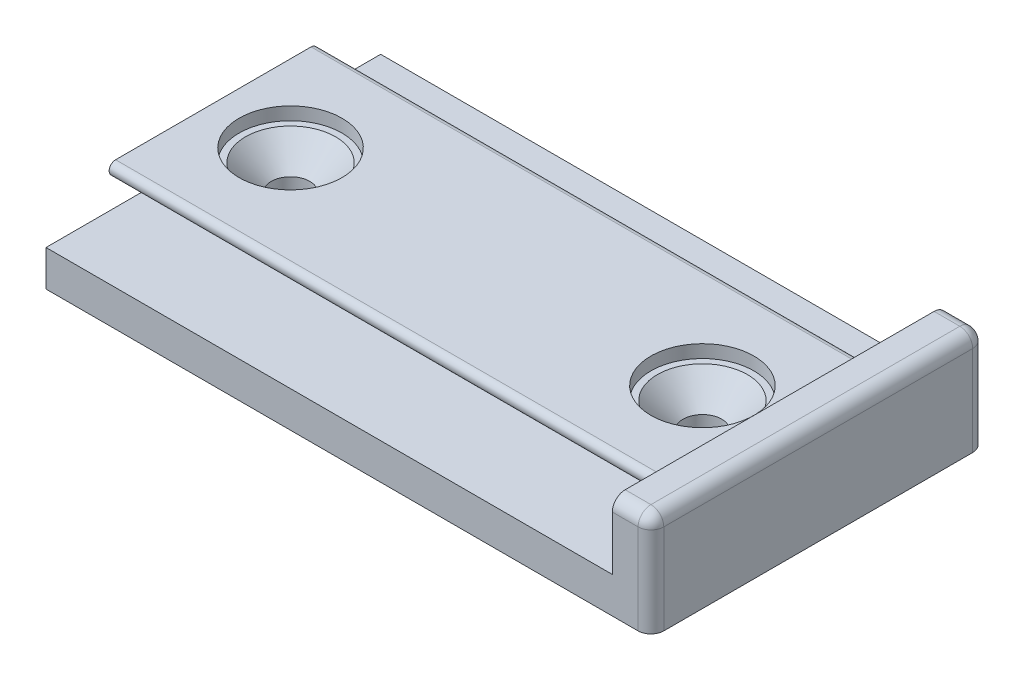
ISO-10303-21;
HEADER;
FILE_DESCRIPTION(('STEP AP214'),'2;1');
FILE_NAME('part.step','',(''),(''),'','','');
FILE_SCHEMA(('AUTOMOTIVE_DESIGN { 1 0 10303 214 1 1 1 1 }'));
ENDSEC;
DATA;
#1=APPLICATION_CONTEXT('core data for automotive mechanical design processes');
#2=APPLICATION_PROTOCOL_DEFINITION('international standard','automotive_design',2000,#1);
#3=PRODUCT_CONTEXT('',#1,'mechanical');
#4=PRODUCT('Part','Part','',(#3));
#5=PRODUCT_RELATED_PRODUCT_CATEGORY('part','',(#4));
#6=PRODUCT_DEFINITION_FORMATION('','',#4);
#7=PRODUCT_DEFINITION_CONTEXT('part definition',#1,'design');
#8=PRODUCT_DEFINITION('design','',#6,#7);
#9=PRODUCT_DEFINITION_SHAPE('','',#8);
#10=(LENGTH_UNIT() NAMED_UNIT(*) SI_UNIT(.MILLI.,.METRE.));
#11=(NAMED_UNIT(*) PLANE_ANGLE_UNIT() SI_UNIT($,.RADIAN.));
#12=(NAMED_UNIT(*) SI_UNIT($,.STERADIAN.) SOLID_ANGLE_UNIT());
#13=UNCERTAINTY_MEASURE_WITH_UNIT(LENGTH_MEASURE(1.E-05),#10,'distance_accuracy_value','');
#14=(GEOMETRIC_REPRESENTATION_CONTEXT(3) GLOBAL_UNCERTAINTY_ASSIGNED_CONTEXT((#13)) GLOBAL_UNIT_ASSIGNED_CONTEXT((#10,
#11,#12)) REPRESENTATION_CONTEXT('',''));
#15=CARTESIAN_POINT('',(0.,0.,0.));
#16=DIRECTION('',(0.,0.,1.));
#17=DIRECTION('',(1.,0.,0.));
#18=AXIS2_PLACEMENT_3D('',#15,#16,#17);
#19=CARTESIAN_POINT('',(38.,-4.,13.));
#20=DIRECTION('',(0.,1.,0.));
#21=DIRECTION('',(0.,0.,1.));
#22=AXIS2_PLACEMENT_3D('',#19,#20,#21);
#23=CYLINDRICAL_SURFACE('',#22,1.5);
#24=CARTESIAN_POINT('',(38.,3.,13.));
#25=DIRECTION('',(0.,1.,0.));
#26=DIRECTION('',(0.,0.,1.));
#27=AXIS2_PLACEMENT_3D('',#24,#25,#26);
#28=CIRCLE('',#27,1.5);
#29=CARTESIAN_POINT('',(38.,3.,14.5));
#30=VERTEX_POINT('',#29);
#31=EDGE_CURVE('E282',#30,#30,#28,.T.);
#32=ORIENTED_EDGE('',*,*,#31,.T.);
#33=EDGE_LOOP('',(#32));
#34=FACE_BOUND('',#33,.T.);
#35=CARTESIAN_POINT('',(38.,0.,13.));
#36=DIRECTION('',(0.,1.,0.));
#37=DIRECTION('',(0.,0.,1.));
#38=AXIS2_PLACEMENT_3D('',#35,#36,#37);
#39=CIRCLE('',#38,1.5);
#40=CARTESIAN_POINT('',(38.,0.,14.5));
#41=VERTEX_POINT('',#40);
#42=EDGE_CURVE('E212',#41,#41,#39,.F.);
#43=ORIENTED_EDGE('',*,*,#42,.T.);
#44=EDGE_LOOP('',(#43));
#45=FACE_BOUND('',#44,.T.);
#46=ADVANCED_FACE('F32',(#34,#45),#23,.F.);
#47=CARTESIAN_POINT('',(0.,6.,0.));
#48=DIRECTION('',(0.,1.,0.));
#49=DIRECTION('',(0.,0.,1.));
#50=AXIS2_PLACEMENT_3D('',#47,#48,#49);
#51=PLANE('',#50);
#52=CARTESIAN_POINT('',(38.,6.,13.));
#53=DIRECTION('',(0.,1.,0.));
#54=DIRECTION('',(0.,0.,1.));
#55=AXIS2_PLACEMENT_3D('',#52,#53,#54);
#56=CIRCLE('',#55,4.00000000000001);
#57=CARTESIAN_POINT('',(38.,6.,17.));
#58=VERTEX_POINT('',#57);
#59=EDGE_CURVE('E202',#58,#58,#56,.T.);
#60=ORIENTED_EDGE('',*,*,#59,.F.);
#61=EDGE_LOOP('',(#60));
#62=FACE_BOUND('',#61,.T.);
#63=DIRECTION('',(0.,0.,-1.));
#64=VECTOR('',#63,1.);
#65=CARTESIAN_POINT('',(44.,6.,0.));
#66=LINE('',#65,#64);
#67=CARTESIAN_POINT('',(44.,6.,20.5928932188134));
#68=VERTEX_POINT('',#67);
#69=CARTESIAN_POINT('',(44.,6.,5.40710678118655));
#70=VERTEX_POINT('',#69);
#71=EDGE_CURVE('E363',#68,#70,#66,.T.);
#72=ORIENTED_EDGE('',*,*,#71,.T.);
#73=DIRECTION('',(1.,0.,0.));
#74=VECTOR('',#73,1.);
#75=CARTESIAN_POINT('',(0.,6.,5.40710678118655));
#76=LINE('',#75,#74);
#77=CARTESIAN_POINT('',(0.,6.,5.40710678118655));
#78=VERTEX_POINT('',#77);
#79=EDGE_CURVE('E257',#70,#78,#76,.F.);
#80=ORIENTED_EDGE('',*,*,#79,.T.);
#81=DIRECTION('',(0.,0.,1.));
#82=VECTOR('',#81,1.);
#83=CARTESIAN_POINT('',(0.,6.,0.));
#84=LINE('',#83,#82);
#85=CARTESIAN_POINT('',(0.,6.,20.5928932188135));
#86=VERTEX_POINT('',#85);
#87=EDGE_CURVE('E359',#78,#86,#84,.T.);
#88=ORIENTED_EDGE('',*,*,#87,.T.);
#89=DIRECTION('',(1.,0.,0.));
#90=VECTOR('',#89,1.);
#91=CARTESIAN_POINT('',(44.,6.,20.5928932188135));
#92=LINE('',#91,#90);
#93=EDGE_CURVE('E258',#86,#68,#92,.T.);
#94=ORIENTED_EDGE('',*,*,#93,.T.);
#95=EDGE_LOOP('',(#72,#80,#88,#94));
#96=FACE_BOUND('',#95,.T.);
#97=CARTESIAN_POINT('',(6.,6.,13.));
#98=DIRECTION('',(0.,-1.,0.));
#99=DIRECTION('',(0.,0.,-1.));
#100=AXIS2_PLACEMENT_3D('',#97,#98,#99);
#101=CIRCLE('',#100,4.);
#102=CARTESIAN_POINT('',(6.,6.,9.));
#103=VERTEX_POINT('',#102);
#104=EDGE_CURVE('E205',#103,#103,#101,.T.);
#105=ORIENTED_EDGE('',*,*,#104,.T.);
#106=EDGE_LOOP('',(#105));
#107=FACE_BOUND('',#106,.T.);
#108=ADVANCED_FACE('F307',(#62,#96,#107),#51,.T.);
#109=CARTESIAN_POINT('',(0.,0.,0.));
#110=DIRECTION('',(0.,1.,0.));
#111=DIRECTION('',(0.,0.,1.));
#112=AXIS2_PLACEMENT_3D('',#109,#110,#111);
#113=PLANE('',#112);
#114=DIRECTION('',(-1.,0.,0.));
#115=VECTOR('',#114,1.);
#116=CARTESIAN_POINT('',(0.,0.,0.));
#117=LINE('',#116,#115);
#118=CARTESIAN_POINT('',(46.,0.,0.));
#119=VERTEX_POINT('',#118);
#120=CARTESIAN_POINT('',(0.,0.,0.));
#121=VERTEX_POINT('',#120);
#122=EDGE_CURVE('E364',#119,#121,#117,.T.);
#123=ORIENTED_EDGE('',*,*,#122,.F.);
#124=CARTESIAN_POINT('',(46.,0.,1.));
#125=DIRECTION('',(0.,1.,0.));
#126=DIRECTION('',(0.,0.,1.));
#127=AXIS2_PLACEMENT_3D('',#124,#125,#126);
#128=CIRCLE('',#127,1.);
#129=CARTESIAN_POINT('',(47.,0.,1.00000000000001));
#130=VERTEX_POINT('',#129);
#131=EDGE_CURVE('E384',#119,#130,#128,.F.);
#132=ORIENTED_EDGE('',*,*,#131,.T.);
#133=DIRECTION('',(0.,0.,-1.));
#134=VECTOR('',#133,1.);
#135=CARTESIAN_POINT('',(47.,0.,26.));
#136=LINE('',#135,#134);
#137=CARTESIAN_POINT('',(47.,0.,25.));
#138=VERTEX_POINT('',#137);
#139=EDGE_CURVE('E195',#138,#130,#136,.T.);
#140=ORIENTED_EDGE('',*,*,#139,.F.);
#141=CARTESIAN_POINT('',(46.,0.,25.));
#142=DIRECTION('',(0.,1.,0.));
#143=DIRECTION('',(0.,0.,1.));
#144=AXIS2_PLACEMENT_3D('',#141,#142,#143);
#145=CIRCLE('',#144,1.);
#146=CARTESIAN_POINT('',(46.,0.,26.));
#147=VERTEX_POINT('',#146);
#148=EDGE_CURVE('E55',#138,#147,#145,.F.);
#149=ORIENTED_EDGE('',*,*,#148,.T.);
#150=DIRECTION('',(1.,0.,0.));
#151=VECTOR('',#150,1.);
#152=CARTESIAN_POINT('',(0.,0.,26.));
#153=LINE('',#152,#151);
#154=CARTESIAN_POINT('',(0.,0.,26.));
#155=VERTEX_POINT('',#154);
#156=EDGE_CURVE('E368',#155,#147,#153,.T.);
#157=ORIENTED_EDGE('',*,*,#156,.F.);
#158=DIRECTION('',(0.,0.,1.));
#159=VECTOR('',#158,1.);
#160=CARTESIAN_POINT('',(0.,0.,0.));
#161=LINE('',#160,#159);
#162=EDGE_CURVE('E172',#121,#155,#161,.T.);
#163=ORIENTED_EDGE('',*,*,#162,.F.);
#164=EDGE_LOOP('',(#123,#132,#140,#149,#157,#163));
#165=FACE_BOUND('',#164,.T.);
#166=CARTESIAN_POINT('',(6.,0.,13.));
#167=DIRECTION('',(0.,1.,0.));
#168=DIRECTION('',(0.,0.,1.));
#169=AXIS2_PLACEMENT_3D('',#166,#167,#168);
#170=CIRCLE('',#169,1.5);
#171=CARTESIAN_POINT('',(6.,0.,14.5));
#172=VERTEX_POINT('',#171);
#173=EDGE_CURVE('E225',#172,#172,#170,.T.);
#174=ORIENTED_EDGE('',*,*,#173,.T.);
#175=EDGE_LOOP('',(#174));
#176=FACE_BOUND('',#175,.T.);
#177=ORIENTED_EDGE('',*,*,#42,.F.);
#178=EDGE_LOOP('',(#177));
#179=FACE_BOUND('',#178,.T.);
#180=ADVANCED_FACE('F312',(#165,#176,#179),#113,.F.);
#181=CARTESIAN_POINT('',(0.,6.,0.));
#182=DIRECTION('',(1.,0.,0.));
#183=DIRECTION('',(0.,0.,-1.));
#184=AXIS2_PLACEMENT_3D('',#181,#182,#183);
#185=PLANE('',#184);
#186=ORIENTED_EDGE('',*,*,#87,.F.);
#187=CARTESIAN_POINT('',(0.,5.5,5.40710678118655));
#188=DIRECTION('',(1.,0.,0.));
#189=DIRECTION('',(0.,0.,-1.));
#190=AXIS2_PLACEMENT_3D('',#187,#188,#189);
#191=CIRCLE('',#190,0.5);
#192=CARTESIAN_POINT('',(0.,5.14644660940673,5.05355339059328));
#193=VERTEX_POINT('',#192);
#194=EDGE_CURVE('E269',#78,#193,#191,.F.);
#195=ORIENTED_EDGE('',*,*,#194,.T.);
#196=DIRECTION('',(0.,-0.707106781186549,0.707106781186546));
#197=VECTOR('',#196,1.);
#198=CARTESIAN_POINT('',(0.,6.,4.20000000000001));
#199=LINE('',#198,#197);
#200=CARTESIAN_POINT('',(0.,2.8,7.4));
#201=VERTEX_POINT('',#200);
#202=EDGE_CURVE('E215',#193,#201,#199,.T.);
#203=ORIENTED_EDGE('',*,*,#202,.T.);
#204=DIRECTION('',(0.,0.,-1.));
#205=VECTOR('',#204,1.);
#206=CARTESIAN_POINT('',(0.,2.8,7.4));
#207=LINE('',#206,#205);
#208=CARTESIAN_POINT('',(0.,2.8,0.));
#209=VERTEX_POINT('',#208);
#210=EDGE_CURVE('E217',#201,#209,#207,.T.);
#211=ORIENTED_EDGE('',*,*,#210,.T.);
#212=DIRECTION('',(0.,-1.,0.));
#213=VECTOR('',#212,1.);
#214=CARTESIAN_POINT('',(0.,6.,0.));
#215=LINE('',#214,#213);
#216=EDGE_CURVE('E366',#209,#121,#215,.T.);
#217=ORIENTED_EDGE('',*,*,#216,.T.);
#218=ORIENTED_EDGE('',*,*,#162,.T.);
#219=DIRECTION('',(0.,-1.,0.));
#220=VECTOR('',#219,1.);
#221=CARTESIAN_POINT('',(0.,6.,26.));
#222=LINE('',#221,#220);
#223=CARTESIAN_POINT('',(0.,2.8,26.));
#224=VERTEX_POINT('',#223);
#225=EDGE_CURVE('E377',#224,#155,#222,.T.);
#226=ORIENTED_EDGE('',*,*,#225,.F.);
#227=DIRECTION('',(0.,0.,-1.));
#228=VECTOR('',#227,1.);
#229=CARTESIAN_POINT('',(0.,2.8,18.6));
#230=LINE('',#229,#228);
#231=CARTESIAN_POINT('',(0.,2.8,18.6));
#232=VERTEX_POINT('',#231);
#233=EDGE_CURVE('E168',#224,#232,#230,.T.);
#234=ORIENTED_EDGE('',*,*,#233,.T.);
#235=DIRECTION('',(0.,0.707106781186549,0.707106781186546));
#236=VECTOR('',#235,1.);
#237=CARTESIAN_POINT('',(0.,6.,21.8));
#238=LINE('',#237,#236);
#239=CARTESIAN_POINT('',(0.,5.14644660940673,20.9464466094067));
#240=VERTEX_POINT('',#239);
#241=EDGE_CURVE('E170',#232,#240,#238,.T.);
#242=ORIENTED_EDGE('',*,*,#241,.T.);
#243=CARTESIAN_POINT('',(0.,5.5,20.5928932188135));
#244=DIRECTION('',(1.,0.,0.));
#245=DIRECTION('',(0.,0.,-1.));
#246=AXIS2_PLACEMENT_3D('',#243,#244,#245);
#247=CIRCLE('',#246,0.5);
#248=EDGE_CURVE('E267',#240,#86,#247,.F.);
#249=ORIENTED_EDGE('',*,*,#248,.T.);
#250=EDGE_LOOP('',(#186,#195,#203,#211,#217,#218,#226,#234,#242,#249));
#251=FACE_BOUND('',#250,.T.);
#252=ADVANCED_FACE('F339',(#251),#185,.F.);
#253=CARTESIAN_POINT('',(0.,6.,26.));
#254=DIRECTION('',(0.,0.,-1.));
#255=DIRECTION('',(-1.,0.,0.));
#256=AXIS2_PLACEMENT_3D('',#253,#254,#255);
#257=PLANE('',#256);
#258=ORIENTED_EDGE('',*,*,#156,.T.);
#259=DIRECTION('',(0.,-1.,0.));
#260=VECTOR('',#259,1.);
#261=CARTESIAN_POINT('',(46.,6.,26.));
#262=LINE('',#261,#260);
#263=CARTESIAN_POINT('',(46.,7.,26.));
#264=VERTEX_POINT('',#263);
#265=EDGE_CURVE('E11',#147,#264,#262,.F.);
#266=ORIENTED_EDGE('',*,*,#265,.T.);
#267=DIRECTION('',(-1.,0.,0.));
#268=VECTOR('',#267,1.);
#269=CARTESIAN_POINT('',(0.,7.,26.));
#270=LINE('',#269,#268);
#271=CARTESIAN_POINT('',(44.,7.,26.));
#272=VERTEX_POINT('',#271);
#273=EDGE_CURVE('E41',#264,#272,#270,.T.);
#274=ORIENTED_EDGE('',*,*,#273,.T.);
#275=DIRECTION('',(0.,-1.,0.));
#276=VECTOR('',#275,1.);
#277=CARTESIAN_POINT('',(44.,0.,26.));
#278=LINE('',#277,#276);
#279=CARTESIAN_POINT('',(44.,2.8,26.));
#280=VERTEX_POINT('',#279);
#281=EDGE_CURVE('E146',#272,#280,#278,.T.);
#282=ORIENTED_EDGE('',*,*,#281,.T.);
#283=DIRECTION('',(1.,0.,0.));
#284=VECTOR('',#283,1.);
#285=CARTESIAN_POINT('',(0.,2.8,26.));
#286=LINE('',#285,#284);
#287=EDGE_CURVE('E150',#224,#280,#286,.T.);
#288=ORIENTED_EDGE('',*,*,#287,.F.);
#289=ORIENTED_EDGE('',*,*,#225,.T.);
#290=EDGE_LOOP('',(#258,#266,#274,#282,#288,#289));
#291=FACE_BOUND('',#290,.T.);
#292=ADVANCED_FACE('F148',(#291),#257,.F.);
#293=CARTESIAN_POINT('',(0.,6.,0.));
#294=DIRECTION('',(0.,0.,1.));
#295=DIRECTION('',(1.,0.,0.));
#296=AXIS2_PLACEMENT_3D('',#293,#294,#295);
#297=PLANE('',#296);
#298=DIRECTION('',(0.,1.,0.));
#299=VECTOR('',#298,1.);
#300=CARTESIAN_POINT('',(44.,0.,0.));
#301=LINE('',#300,#299);
#302=CARTESIAN_POINT('',(44.,2.8,0.));
#303=VERTEX_POINT('',#302);
#304=CARTESIAN_POINT('',(44.,7.,0.));
#305=VERTEX_POINT('',#304);
#306=EDGE_CURVE('E154',#303,#305,#301,.T.);
#307=ORIENTED_EDGE('',*,*,#306,.T.);
#308=DIRECTION('',(-1.,0.,0.));
#309=VECTOR('',#308,1.);
#310=CARTESIAN_POINT('',(0.,7.,0.));
#311=LINE('',#310,#309);
#312=CARTESIAN_POINT('',(46.,7.,0.));
#313=VERTEX_POINT('',#312);
#314=EDGE_CURVE('E431',#305,#313,#311,.F.);
#315=ORIENTED_EDGE('',*,*,#314,.T.);
#316=DIRECTION('',(0.,1.,0.));
#317=VECTOR('',#316,1.);
#318=CARTESIAN_POINT('',(46.,6.,0.));
#319=LINE('',#318,#317);
#320=EDGE_CURVE('E382',#313,#119,#319,.F.);
#321=ORIENTED_EDGE('',*,*,#320,.T.);
#322=ORIENTED_EDGE('',*,*,#122,.T.);
#323=ORIENTED_EDGE('',*,*,#216,.F.);
#324=DIRECTION('',(1.,0.,0.));
#325=VECTOR('',#324,1.);
#326=CARTESIAN_POINT('',(0.,2.8,0.));
#327=LINE('',#326,#325);
#328=EDGE_CURVE('E164',#209,#303,#327,.T.);
#329=ORIENTED_EDGE('',*,*,#328,.T.);
#330=EDGE_LOOP('',(#307,#315,#321,#322,#323,#329));
#331=FACE_BOUND('',#330,.T.);
#332=ADVANCED_FACE('F333',(#331),#297,.F.);
#333=CARTESIAN_POINT('',(0.,6.,21.8));
#334=DIRECTION('',(0.,0.707106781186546,-0.707106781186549));
#335=DIRECTION('',(0.,0.707106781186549,0.707106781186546));
#336=AXIS2_PLACEMENT_3D('',#333,#334,#335);
#337=PLANE('',#336);
#338=DIRECTION('',(0.,0.707106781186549,0.707106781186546));
#339=VECTOR('',#338,1.);
#340=CARTESIAN_POINT('',(44.,6.,21.8));
#341=LINE('',#340,#339);
#342=CARTESIAN_POINT('',(44.,2.8,18.6));
#343=VERTEX_POINT('',#342);
#344=CARTESIAN_POINT('',(44.,5.14644660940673,20.9464466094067));
#345=VERTEX_POINT('',#344);
#346=EDGE_CURVE('E161',#343,#345,#341,.T.);
#347=ORIENTED_EDGE('',*,*,#346,.T.);
#348=DIRECTION('',(1.,0.,0.));
#349=VECTOR('',#348,1.);
#350=CARTESIAN_POINT('',(0.,5.14644660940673,20.9464466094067));
#351=LINE('',#350,#349);
#352=EDGE_CURVE('E271',#345,#240,#351,.F.);
#353=ORIENTED_EDGE('',*,*,#352,.T.);
#354=ORIENTED_EDGE('',*,*,#241,.F.);
#355=DIRECTION('',(1.,0.,0.));
#356=VECTOR('',#355,1.);
#357=CARTESIAN_POINT('',(0.,2.8,18.6));
#358=LINE('',#357,#356);
#359=EDGE_CURVE('E169',#232,#343,#358,.T.);
#360=ORIENTED_EDGE('',*,*,#359,.T.);
#361=EDGE_LOOP('',(#347,#353,#354,#360));
#362=FACE_BOUND('',#361,.T.);
#363=ADVANCED_FACE('F330',(#362),#337,.F.);
#364=CARTESIAN_POINT('',(0.,2.8,18.6));
#365=DIRECTION('',(0.,-1.,0.));
#366=DIRECTION('',(0.,0.,-1.));
#367=AXIS2_PLACEMENT_3D('',#364,#365,#366);
#368=PLANE('',#367);
#369=DIRECTION('',(0.,0.,-1.));
#370=VECTOR('',#369,1.);
#371=CARTESIAN_POINT('',(44.,2.8,18.6));
#372=LINE('',#371,#370);
#373=EDGE_CURVE('E157',#280,#343,#372,.T.);
#374=ORIENTED_EDGE('',*,*,#373,.T.);
#375=ORIENTED_EDGE('',*,*,#359,.F.);
#376=ORIENTED_EDGE('',*,*,#233,.F.);
#377=ORIENTED_EDGE('',*,*,#287,.T.);
#378=EDGE_LOOP('',(#374,#375,#376,#377));
#379=FACE_BOUND('',#378,.T.);
#380=ADVANCED_FACE('F166',(#379),#368,.F.);
#381=CARTESIAN_POINT('',(0.,2.8,7.4));
#382=DIRECTION('',(0.,-1.,0.));
#383=DIRECTION('',(0.,0.,-1.));
#384=AXIS2_PLACEMENT_3D('',#381,#382,#383);
#385=PLANE('',#384);
#386=DIRECTION('',(0.,0.,-1.));
#387=VECTOR('',#386,1.);
#388=CARTESIAN_POINT('',(44.,2.8,7.39999999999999));
#389=LINE('',#388,#387);
#390=CARTESIAN_POINT('',(44.,2.8,7.39999999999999));
#391=VERTEX_POINT('',#390);
#392=EDGE_CURVE('E218',#391,#303,#389,.T.);
#393=ORIENTED_EDGE('',*,*,#392,.T.);
#394=ORIENTED_EDGE('',*,*,#328,.F.);
#395=ORIENTED_EDGE('',*,*,#210,.F.);
#396=DIRECTION('',(1.,0.,0.));
#397=VECTOR('',#396,1.);
#398=CARTESIAN_POINT('',(0.,2.8,7.4));
#399=LINE('',#398,#397);
#400=EDGE_CURVE('E221',#201,#391,#399,.T.);
#401=ORIENTED_EDGE('',*,*,#400,.T.);
#402=EDGE_LOOP('',(#393,#394,#395,#401));
#403=FACE_BOUND('',#402,.T.);
#404=ADVANCED_FACE('F243',(#403),#385,.F.);
#405=CARTESIAN_POINT('',(0.,6.,4.20000000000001));
#406=DIRECTION('',(0.,0.707106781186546,0.707106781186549));
#407=DIRECTION('',(0.,-0.707106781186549,0.707106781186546));
#408=AXIS2_PLACEMENT_3D('',#405,#406,#407);
#409=PLANE('',#408);
#410=ORIENTED_EDGE('',*,*,#202,.F.);
#411=DIRECTION('',(1.,0.,0.));
#412=VECTOR('',#411,1.);
#413=CARTESIAN_POINT('',(44.,5.14644660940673,5.05355339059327));
#414=LINE('',#413,#412);
#415=CARTESIAN_POINT('',(44.,5.14644660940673,5.05355339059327));
#416=VERTEX_POINT('',#415);
#417=EDGE_CURVE('E249',#193,#416,#414,.T.);
#418=ORIENTED_EDGE('',*,*,#417,.T.);
#419=DIRECTION('',(0.,-0.707106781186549,0.707106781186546));
#420=VECTOR('',#419,1.);
#421=CARTESIAN_POINT('',(44.,6.,4.2));
#422=LINE('',#421,#420);
#423=EDGE_CURVE('E222',#416,#391,#422,.T.);
#424=ORIENTED_EDGE('',*,*,#423,.T.);
#425=ORIENTED_EDGE('',*,*,#400,.F.);
#426=EDGE_LOOP('',(#410,#418,#424,#425));
#427=FACE_BOUND('',#426,.T.);
#428=ADVANCED_FACE('F246',(#427),#409,.F.);
#429=CARTESIAN_POINT('',(0.,5.5,5.40710678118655));
#430=DIRECTION('',(-1.,0.,0.));
#431=DIRECTION('',(0.,0.,1.));
#432=AXIS2_PLACEMENT_3D('',#429,#430,#431);
#433=CYLINDRICAL_SURFACE('',#432,0.5);
#434=ORIENTED_EDGE('',*,*,#194,.F.);
#435=ORIENTED_EDGE('',*,*,#79,.F.);
#436=CARTESIAN_POINT('',(44.,5.5,5.40710678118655));
#437=DIRECTION('',(-1.,0.,0.));
#438=DIRECTION('',(0.,0.,1.));
#439=AXIS2_PLACEMENT_3D('',#436,#437,#438);
#440=CIRCLE('',#439,0.5);
#441=EDGE_CURVE('E251',#416,#70,#440,.F.);
#442=ORIENTED_EDGE('',*,*,#441,.F.);
#443=ORIENTED_EDGE('',*,*,#417,.F.);
#444=EDGE_LOOP('',(#434,#435,#442,#443));
#445=FACE_BOUND('',#444,.T.);
#446=ADVANCED_FACE('F256',(#445),#433,.T.);
#447=CARTESIAN_POINT('',(0.,5.5,20.5928932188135));
#448=DIRECTION('',(-1.,0.,0.));
#449=DIRECTION('',(0.,0.,1.));
#450=AXIS2_PLACEMENT_3D('',#447,#448,#449);
#451=CYLINDRICAL_SURFACE('',#450,0.5);
#452=ORIENTED_EDGE('',*,*,#248,.F.);
#453=ORIENTED_EDGE('',*,*,#352,.F.);
#454=CARTESIAN_POINT('',(44.,5.5,20.5928932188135));
#455=DIRECTION('',(-1.,0.,0.));
#456=DIRECTION('',(0.,0.,1.));
#457=AXIS2_PLACEMENT_3D('',#454,#455,#456);
#458=CIRCLE('',#457,0.5);
#459=EDGE_CURVE('E259',#68,#345,#458,.F.);
#460=ORIENTED_EDGE('',*,*,#459,.F.);
#461=ORIENTED_EDGE('',*,*,#93,.F.);
#462=EDGE_LOOP('',(#452,#453,#460,#461));
#463=FACE_BOUND('',#462,.T.);
#464=ADVANCED_FACE('F324',(#463),#451,.T.);
#465=CARTESIAN_POINT('',(6.,-4.,13.));
#466=DIRECTION('',(0.,1.,0.));
#467=DIRECTION('',(0.,0.,1.));
#468=AXIS2_PLACEMENT_3D('',#465,#466,#467);
#469=CYLINDRICAL_SURFACE('',#468,1.5);
#470=CARTESIAN_POINT('',(6.,3.,13.));
#471=DIRECTION('',(0.,-1.,0.));
#472=DIRECTION('',(0.,0.,-1.));
#473=AXIS2_PLACEMENT_3D('',#470,#471,#472);
#474=CIRCLE('',#473,1.5);
#475=CARTESIAN_POINT('',(6.,3.,11.5));
#476=VERTEX_POINT('',#475);
#477=EDGE_CURVE('E273',#476,#476,#474,.F.);
#478=ORIENTED_EDGE('',*,*,#477,.T.);
#479=EDGE_LOOP('',(#478));
#480=FACE_BOUND('',#479,.T.);
#481=ORIENTED_EDGE('',*,*,#173,.F.);
#482=EDGE_LOOP('',(#481));
#483=FACE_BOUND('',#482,.T.);
#484=ADVANCED_FACE('F320',(#480,#483),#469,.F.);
#485=CARTESIAN_POINT('',(6.,5.,13.));
#486=DIRECTION('',(0.,-1.,0.));
#487=DIRECTION('',(0.,0.,-1.));
#488=AXIS2_PLACEMENT_3D('',#485,#486,#487);
#489=PLANE('',#488);
#490=CARTESIAN_POINT('',(6.,5.,13.));
#491=DIRECTION('',(0.,-1.,0.));
#492=DIRECTION('',(0.,0.,-1.));
#493=AXIS2_PLACEMENT_3D('',#490,#491,#492);
#494=CIRCLE('',#493,3.50000000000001);
#495=CARTESIAN_POINT('',(6.,5.,9.49999999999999));
#496=VERTEX_POINT('',#495);
#497=EDGE_CURVE('E280',#496,#496,#494,.T.);
#498=ORIENTED_EDGE('',*,*,#497,.T.);
#499=EDGE_LOOP('',(#498));
#500=FACE_BOUND('',#499,.T.);
#501=CARTESIAN_POINT('',(6.,5.,13.));
#502=DIRECTION('',(0.,-1.,0.));
#503=DIRECTION('',(0.,0.,-1.));
#504=AXIS2_PLACEMENT_3D('',#501,#502,#503);
#505=CIRCLE('',#504,4.);
#506=CARTESIAN_POINT('',(6.,5.,9.));
#507=VERTEX_POINT('',#506);
#508=EDGE_CURVE('E209',#507,#507,#505,.T.);
#509=ORIENTED_EDGE('',*,*,#508,.F.);
#510=EDGE_LOOP('',(#509));
#511=FACE_BOUND('',#510,.T.);
#512=ADVANCED_FACE('F323',(#500,#511),#489,.F.);
#513=CARTESIAN_POINT('',(6.,5.,13.));
#514=DIRECTION('',(0.,1.,0.));
#515=DIRECTION('',(0.,0.,1.));
#516=AXIS2_PLACEMENT_3D('',#513,#514,#515);
#517=CYLINDRICAL_SURFACE('',#516,4.);
#518=ORIENTED_EDGE('',*,*,#508,.T.);
#519=EDGE_LOOP('',(#518));
#520=FACE_BOUND('',#519,.T.);
#521=ORIENTED_EDGE('',*,*,#104,.F.);
#522=EDGE_LOOP('',(#521));
#523=FACE_BOUND('',#522,.T.);
#524=ADVANCED_FACE('F318',(#520,#523),#517,.F.);
#525=CARTESIAN_POINT('',(38.,5.,13.));
#526=DIRECTION('',(0.,1.,0.));
#527=DIRECTION('',(0.,0.,1.));
#528=AXIS2_PLACEMENT_3D('',#525,#526,#527);
#529=CYLINDRICAL_SURFACE('',#528,4.00000000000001);
#530=CARTESIAN_POINT('',(38.,5.,13.));
#531=DIRECTION('',(0.,1.,0.));
#532=DIRECTION('',(0.,0.,1.));
#533=AXIS2_PLACEMENT_3D('',#530,#531,#532);
#534=CIRCLE('',#533,4.00000000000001);
#535=CARTESIAN_POINT('',(38.,5.,17.));
#536=VERTEX_POINT('',#535);
#537=EDGE_CURVE('E206',#536,#536,#534,.T.);
#538=ORIENTED_EDGE('',*,*,#537,.F.);
#539=EDGE_LOOP('',(#538));
#540=FACE_BOUND('',#539,.T.);
#541=ORIENTED_EDGE('',*,*,#59,.T.);
#542=EDGE_LOOP('',(#541));
#543=FACE_BOUND('',#542,.T.);
#544=ADVANCED_FACE('F450',(#540,#543),#529,.F.);
#545=CARTESIAN_POINT('',(38.,5.,13.));
#546=DIRECTION('',(0.,1.,0.));
#547=DIRECTION('',(0.,0.,1.));
#548=AXIS2_PLACEMENT_3D('',#545,#546,#547);
#549=PLANE('',#548);
#550=CARTESIAN_POINT('',(38.,5.,13.));
#551=DIRECTION('',(0.,1.,0.));
#552=DIRECTION('',(0.,0.,1.));
#553=AXIS2_PLACEMENT_3D('',#550,#551,#552);
#554=CIRCLE('',#553,3.50000000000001);
#555=CARTESIAN_POINT('',(38.,5.,16.5));
#556=VERTEX_POINT('',#555);
#557=EDGE_CURVE('E184',#556,#556,#554,.F.);
#558=ORIENTED_EDGE('',*,*,#557,.T.);
#559=EDGE_LOOP('',(#558));
#560=FACE_BOUND('',#559,.T.);
#561=ORIENTED_EDGE('',*,*,#537,.T.);
#562=EDGE_LOOP('',(#561));
#563=FACE_BOUND('',#562,.T.);
#564=ADVANCED_FACE('F289',(#560,#563),#549,.T.);
#565=CARTESIAN_POINT('',(6.,3.,13.));
#566=DIRECTION('',(0.,1.,0.));
#567=DIRECTION('',(0.,0.,1.));
#568=AXIS2_PLACEMENT_3D('',#565,#566,#567);
#569=CONICAL_SURFACE('',#568,1.5,0.78539816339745);
#570=ORIENTED_EDGE('',*,*,#497,.F.);
#571=EDGE_LOOP('',(#570));
#572=FACE_BOUND('',#571,.T.);
#573=ORIENTED_EDGE('',*,*,#477,.F.);
#574=EDGE_LOOP('',(#573));
#575=FACE_BOUND('',#574,.T.);
#576=ADVANCED_FACE('F295',(#572,#575),#569,.F.);
#577=CARTESIAN_POINT('',(38.,3.,13.));
#578=DIRECTION('',(0.,1.,0.));
#579=DIRECTION('',(0.,0.,1.));
#580=AXIS2_PLACEMENT_3D('',#577,#578,#579);
#581=CONICAL_SURFACE('',#580,1.5,0.78539816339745);
#582=ORIENTED_EDGE('',*,*,#557,.F.);
#583=EDGE_LOOP('',(#582));
#584=FACE_BOUND('',#583,.T.);
#585=ORIENTED_EDGE('',*,*,#31,.F.);
#586=EDGE_LOOP('',(#585));
#587=FACE_BOUND('',#586,.T.);
#588=ADVANCED_FACE('F292',(#584,#587),#581,.F.);
#589=CARTESIAN_POINT('',(44.,0.,0.));
#590=DIRECTION('',(-1.,0.,0.));
#591=DIRECTION('',(0.,0.,1.));
#592=AXIS2_PLACEMENT_3D('',#589,#590,#591);
#593=PLANE('',#592);
#594=DIRECTION('',(0.,0.,1.));
#595=VECTOR('',#594,1.);
#596=CARTESIAN_POINT('',(44.,8.,26.));
#597=LINE('',#596,#595);
#598=CARTESIAN_POINT('',(44.,8.,1.00000000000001));
#599=VERTEX_POINT('',#598);
#600=CARTESIAN_POINT('',(44.,8.,25.));
#601=VERTEX_POINT('',#600);
#602=EDGE_CURVE('E198',#599,#601,#597,.T.);
#603=ORIENTED_EDGE('',*,*,#602,.F.);
#604=CARTESIAN_POINT('',(44.,7.,1.));
#605=DIRECTION('',(-1.,0.,0.));
#606=DIRECTION('',(0.,0.,1.));
#607=AXIS2_PLACEMENT_3D('',#604,#605,#606);
#608=CIRCLE('',#607,1.);
#609=EDGE_CURVE('E430',#599,#305,#608,.T.);
#610=ORIENTED_EDGE('',*,*,#609,.T.);
#611=ORIENTED_EDGE('',*,*,#306,.F.);
#612=ORIENTED_EDGE('',*,*,#392,.F.);
#613=ORIENTED_EDGE('',*,*,#423,.F.);
#614=ORIENTED_EDGE('',*,*,#441,.T.);
#615=ORIENTED_EDGE('',*,*,#71,.F.);
#616=ORIENTED_EDGE('',*,*,#459,.T.);
#617=ORIENTED_EDGE('',*,*,#346,.F.);
#618=ORIENTED_EDGE('',*,*,#373,.F.);
#619=ORIENTED_EDGE('',*,*,#281,.F.);
#620=CARTESIAN_POINT('',(44.,7.,25.));
#621=DIRECTION('',(-1.,0.,0.));
#622=DIRECTION('',(0.,0.,1.));
#623=AXIS2_PLACEMENT_3D('',#620,#621,#622);
#624=CIRCLE('',#623,1.);
#625=EDGE_CURVE('E188',#272,#601,#624,.T.);
#626=ORIENTED_EDGE('',*,*,#625,.T.);
#627=EDGE_LOOP('',(#603,#610,#611,#612,#613,#614,#615,#616,#617,#618,#619,#626));
#628=FACE_BOUND('',#627,.T.);
#629=ADVANCED_FACE('F159',(#628),#593,.T.);
#630=CARTESIAN_POINT('',(47.,8.,26.));
#631=DIRECTION('',(0.,-1.,0.));
#632=DIRECTION('',(0.,0.,-1.));
#633=AXIS2_PLACEMENT_3D('',#630,#631,#632);
#634=PLANE('',#633);
#635=DIRECTION('',(0.,0.,1.));
#636=VECTOR('',#635,1.);
#637=CARTESIAN_POINT('',(46.,8.,26.));
#638=LINE('',#637,#636);
#639=CARTESIAN_POINT('',(46.,8.,25.));
#640=VERTEX_POINT('',#639);
#641=CARTESIAN_POINT('',(46.,8.,1.));
#642=VERTEX_POINT('',#641);
#643=EDGE_CURVE('E183',#640,#642,#638,.F.);
#644=ORIENTED_EDGE('',*,*,#643,.T.);
#645=DIRECTION('',(-1.,0.,0.));
#646=VECTOR('',#645,1.);
#647=CARTESIAN_POINT('',(47.,8.,1.));
#648=LINE('',#647,#646);
#649=EDGE_CURVE('E186',#642,#599,#648,.T.);
#650=ORIENTED_EDGE('',*,*,#649,.T.);
#651=ORIENTED_EDGE('',*,*,#602,.T.);
#652=DIRECTION('',(-1.,0.,0.));
#653=VECTOR('',#652,1.);
#654=CARTESIAN_POINT('',(47.,8.,25.));
#655=LINE('',#654,#653);
#656=EDGE_CURVE('E181',#601,#640,#655,.F.);
#657=ORIENTED_EDGE('',*,*,#656,.T.);
#658=EDGE_LOOP('',(#644,#650,#651,#657));
#659=FACE_BOUND('',#658,.T.);
#660=ADVANCED_FACE('F301',(#659),#634,.F.);
#661=CARTESIAN_POINT('',(47.,0.,0.));
#662=DIRECTION('',(-1.,0.,0.));
#663=DIRECTION('',(0.,0.,1.));
#664=AXIS2_PLACEMENT_3D('',#661,#662,#663);
#665=PLANE('',#664);
#666=ORIENTED_EDGE('',*,*,#139,.T.);
#667=DIRECTION('',(0.,1.,0.));
#668=VECTOR('',#667,1.);
#669=CARTESIAN_POINT('',(47.,0.,1.));
#670=LINE('',#669,#668);
#671=CARTESIAN_POINT('',(47.,7.,1.));
#672=VERTEX_POINT('',#671);
#673=EDGE_CURVE('E391',#130,#672,#670,.T.);
#674=ORIENTED_EDGE('',*,*,#673,.T.);
#675=DIRECTION('',(0.,0.,1.));
#676=VECTOR('',#675,1.);
#677=CARTESIAN_POINT('',(47.,7.,0.));
#678=LINE('',#677,#676);
#679=CARTESIAN_POINT('',(47.,7.,25.));
#680=VERTEX_POINT('',#679);
#681=EDGE_CURVE('E422',#672,#680,#678,.T.);
#682=ORIENTED_EDGE('',*,*,#681,.T.);
#683=DIRECTION('',(0.,-1.,0.));
#684=VECTOR('',#683,1.);
#685=CARTESIAN_POINT('',(47.,0.,25.));
#686=LINE('',#685,#684);
#687=EDGE_CURVE('E435',#680,#138,#686,.T.);
#688=ORIENTED_EDGE('',*,*,#687,.T.);
#689=EDGE_LOOP('',(#666,#674,#682,#688));
#690=FACE_BOUND('',#689,.T.);
#691=ADVANCED_FACE('F438',(#690),#665,.F.);
#692=CARTESIAN_POINT('',(46.,0.,25.));
#693=DIRECTION('',(0.,-1.,0.));
#694=DIRECTION('',(0.,0.,-1.));
#695=AXIS2_PLACEMENT_3D('',#692,#693,#694);
#696=CYLINDRICAL_SURFACE('',#695,1.);
#697=ORIENTED_EDGE('',*,*,#148,.F.);
#698=ORIENTED_EDGE('',*,*,#687,.F.);
#699=CARTESIAN_POINT('',(46.,7.,25.));
#700=DIRECTION('',(0.,1.,0.));
#701=DIRECTION('',(0.,0.,1.));
#702=AXIS2_PLACEMENT_3D('',#699,#700,#701);
#703=CIRCLE('',#702,1.);
#704=EDGE_CURVE('E36',#264,#680,#703,.T.);
#705=ORIENTED_EDGE('',*,*,#704,.F.);
#706=ORIENTED_EDGE('',*,*,#265,.F.);
#707=EDGE_LOOP('',(#697,#698,#705,#706));
#708=FACE_BOUND('',#707,.T.);
#709=ADVANCED_FACE('F34',(#708),#696,.T.);
#710=CARTESIAN_POINT('',(0.,7.,25.));
#711=DIRECTION('',(-1.,0.,0.));
#712=DIRECTION('',(0.,0.,1.));
#713=AXIS2_PLACEMENT_3D('',#710,#711,#712);
#714=CYLINDRICAL_SURFACE('',#713,1.);
#715=ORIENTED_EDGE('',*,*,#625,.F.);
#716=ORIENTED_EDGE('',*,*,#273,.F.);
#717=CARTESIAN_POINT('',(46.,7.,25.));
#718=DIRECTION('',(1.,0.,0.));
#719=DIRECTION('',(0.,0.,-1.));
#720=AXIS2_PLACEMENT_3D('',#717,#718,#719);
#721=CIRCLE('',#720,1.);
#722=EDGE_CURVE('E407',#640,#264,#721,.T.);
#723=ORIENTED_EDGE('',*,*,#722,.F.);
#724=ORIENTED_EDGE('',*,*,#656,.F.);
#725=EDGE_LOOP('',(#715,#716,#723,#724));
#726=FACE_BOUND('',#725,.T.);
#727=ADVANCED_FACE('F429',(#726),#714,.T.);
#728=CARTESIAN_POINT('',(46.,7.,25.));
#729=DIRECTION('',(0.,0.,1.));
#730=DIRECTION('',(1.,0.,0.));
#731=AXIS2_PLACEMENT_3D('',#728,#729,#730);
#732=SPHERICAL_SURFACE('',#731,1.);
#733=ORIENTED_EDGE('',*,*,#722,.T.);
#734=ORIENTED_EDGE('',*,*,#704,.T.);
#735=CARTESIAN_POINT('',(46.,7.,25.));
#736=DIRECTION('',(0.,0.,1.));
#737=DIRECTION('',(1.,0.,0.));
#738=AXIS2_PLACEMENT_3D('',#735,#736,#737);
#739=CIRCLE('',#738,1.);
#740=EDGE_CURVE('E405',#640,#680,#739,.F.);
#741=ORIENTED_EDGE('',*,*,#740,.F.);
#742=EDGE_LOOP('',(#733,#734,#741));
#743=FACE_BOUND('',#742,.T.);
#744=ADVANCED_FACE('F414',(#743),#732,.T.);
#745=CARTESIAN_POINT('',(46.,0.,1.));
#746=DIRECTION('',(0.,1.,0.));
#747=DIRECTION('',(0.,0.,1.));
#748=AXIS2_PLACEMENT_3D('',#745,#746,#747);
#749=CYLINDRICAL_SURFACE('',#748,1.);
#750=ORIENTED_EDGE('',*,*,#131,.F.);
#751=ORIENTED_EDGE('',*,*,#320,.F.);
#752=CARTESIAN_POINT('',(46.,7.,1.));
#753=DIRECTION('',(0.,1.,0.));
#754=DIRECTION('',(0.,0.,1.));
#755=AXIS2_PLACEMENT_3D('',#752,#753,#754);
#756=CIRCLE('',#755,1.);
#757=EDGE_CURVE('E403',#672,#313,#756,.T.);
#758=ORIENTED_EDGE('',*,*,#757,.F.);
#759=ORIENTED_EDGE('',*,*,#673,.F.);
#760=EDGE_LOOP('',(#750,#751,#758,#759));
#761=FACE_BOUND('',#760,.T.);
#762=ADVANCED_FACE('F388',(#761),#749,.T.);
#763=CARTESIAN_POINT('',(46.,7.,0.));
#764=DIRECTION('',(0.,0.,1.));
#765=DIRECTION('',(1.,0.,0.));
#766=AXIS2_PLACEMENT_3D('',#763,#764,#765);
#767=CYLINDRICAL_SURFACE('',#766,1.);
#768=ORIENTED_EDGE('',*,*,#740,.T.);
#769=ORIENTED_EDGE('',*,*,#681,.F.);
#770=CARTESIAN_POINT('',(46.,7.,1.));
#771=DIRECTION('',(0.,0.,-1.));
#772=DIRECTION('',(-1.,0.,0.));
#773=AXIS2_PLACEMENT_3D('',#770,#771,#772);
#774=CIRCLE('',#773,1.);
#775=EDGE_CURVE('E400',#642,#672,#774,.T.);
#776=ORIENTED_EDGE('',*,*,#775,.F.);
#777=ORIENTED_EDGE('',*,*,#643,.F.);
#778=EDGE_LOOP('',(#768,#769,#776,#777));
#779=FACE_BOUND('',#778,.T.);
#780=ADVANCED_FACE('F420',(#779),#767,.T.);
#781=CARTESIAN_POINT('',(46.,7.,1.));
#782=DIRECTION('',(0.,0.,1.));
#783=DIRECTION('',(1.,0.,0.));
#784=AXIS2_PLACEMENT_3D('',#781,#782,#783);
#785=SPHERICAL_SURFACE('',#784,1.);
#786=ORIENTED_EDGE('',*,*,#775,.T.);
#787=ORIENTED_EDGE('',*,*,#757,.T.);
#788=CARTESIAN_POINT('',(46.,7.,1.));
#789=DIRECTION('',(1.,0.,0.));
#790=DIRECTION('',(0.,0.,-1.));
#791=AXIS2_PLACEMENT_3D('',#788,#789,#790);
#792=CIRCLE('',#791,1.);
#793=EDGE_CURVE('E397',#642,#313,#792,.F.);
#794=ORIENTED_EDGE('',*,*,#793,.F.);
#795=EDGE_LOOP('',(#786,#787,#794));
#796=FACE_BOUND('',#795,.T.);
#797=ADVANCED_FACE('F605',(#796),#785,.T.);
#798=CARTESIAN_POINT('',(47.,7.,1.));
#799=DIRECTION('',(-1.,0.,0.));
#800=DIRECTION('',(0.,0.,1.));
#801=AXIS2_PLACEMENT_3D('',#798,#799,#800);
#802=CYLINDRICAL_SURFACE('',#801,1.);
#803=ORIENTED_EDGE('',*,*,#793,.T.);
#804=ORIENTED_EDGE('',*,*,#314,.F.);
#805=ORIENTED_EDGE('',*,*,#609,.F.);
#806=ORIENTED_EDGE('',*,*,#649,.F.);
#807=EDGE_LOOP('',(#803,#804,#805,#806));
#808=FACE_BOUND('',#807,.T.);
#809=ADVANCED_FACE('F614',(#808),#802,.T.);
#810=CLOSED_SHELL('',(#46,#108,#180,#252,#292,#332,#363,#380,#404,#428,#446,#464,#484,#512,#524,
#544,#564,#576,#588,#629,#660,#691,#709,#727,#744,#762,#780,#797,#809));
#811=MANIFOLD_SOLID_BREP('B2',#810);
#812=ADVANCED_BREP_SHAPE_REPRESENTATION('',(#18,#811),#14);
#813=SHAPE_DEFINITION_REPRESENTATION(#9,#812);
ENDSEC;
END-ISO-10303-21;
